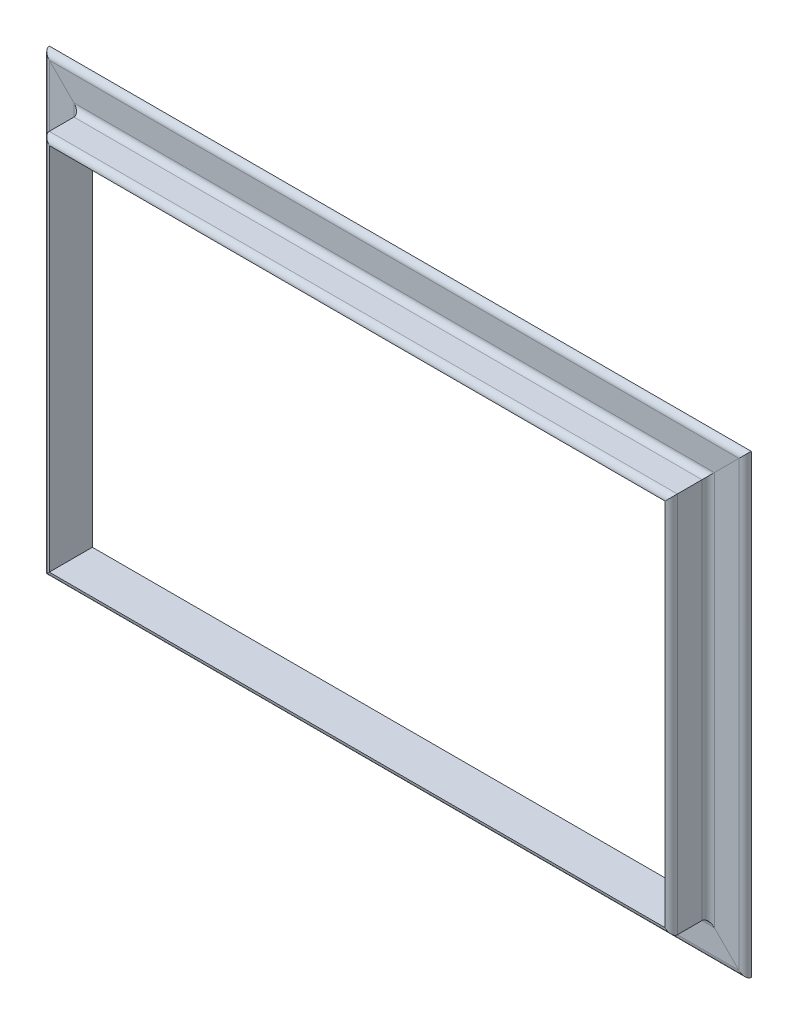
from build123d import *

# Parameters (mm, degrees)
K_TOWNIK_STALOWY_35_X_35_X_5_1_DEPTH      = 550.497474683
K_TOWNIK_STALOWY_35_X_35_X_5_1_DEPTH_BACK = 50.497474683
K_TOWNIK_STALOWY_35_X_35_X_5_1_2_DEPTH    = 400.994949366
K_TOWNIK_STALOWY_35_X_35_X_5_1_3_DEPTH    = 600.994949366
K_TOWNIK_STALOWY_35_X_35_X_5_1_4_DEPTH    = 400.994949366


with BuildPart() as part:
    # Sketch1 → K_townik stalowy 35 X 35 X 5_1 (new, two sides: drawn at the far end of the back side and taken through both)
    with BuildSketch(Plane(origin=(250, -150, 0), x_dir=(0, -1, 0), z_dir=(-1, 0, 0)).offset(-K_TOWNIK_STALOWY_35_X_35_X_5_1_DEPTH_BACK)):
        with BuildLine():
            Line((0, 0), (0, 35))
            ThreePointArc((0, 35), (3.535533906, 33.535533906), (5, 30))
            Line((5, 30), (5, 10))
            ThreePointArc((5, 10), (6.464466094, 6.464466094), (10, 5))
            Line((10, 5), (30, 5))
            ThreePointArc((30, 5), (33.535533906, 3.535533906), (35, 0))
            Line((35, 0), (0, 0))
        make_face()
    extrude(amount=K_TOWNIK_STALOWY_35_X_35_X_5_1_DEPTH + K_TOWNIK_STALOWY_35_X_35_X_5_1_DEPTH_BACK)

    # K_townik stalowy 35 X 35 X 5_1 mitre 1
    split(bisect_by=Plane(origin=(250, -150, 0), x_dir=(0.707106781, -0.707106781, 0), z_dir=(-0.707106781, -0.707106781, 0)), keep=Keep.TOP)

    # K_townik stalowy 35 X 35 X 5_1 mitre 2
    split(bisect_by=Plane(origin=(-250, -150, 0), x_dir=(0.707106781, 0.707106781, 0), z_dir=(0.707106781, -0.707106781, 0)), keep=Keep.TOP)


with BuildPart() as body_2:
    # Sketch1 on segment 2 (on carried to segment 2) → K_townik stalowy 35 X 35 X 5_1 2 (new body)
    with BuildSketch(Plane(origin=(-250, -200.497474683, 0), x_dir=(-1, 0, 0), z_dir=(0, 1, 0))):
        with BuildLine():
            Line((0, 0), (0, 35))
            ThreePointArc((0, 35), (3.535533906, 33.535533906), (5, 30))
            Line((5, 30), (5, 10))
            ThreePointArc((5, 10), (6.464466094, 6.464466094), (10, 5))
            Line((10, 5), (30, 5))
            ThreePointArc((30, 5), (33.535533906, 3.535533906), (35, 0))
            Line((35, 0), (0, 0))
        make_face()
    extrude(amount=K_TOWNIK_STALOWY_35_X_35_X_5_1_2_DEPTH)

    # K_townik stalowy 35 X 35 X 5_1 2 mitre 1
    split(bisect_by=Plane(origin=(-250, -150, 0), x_dir=(-0.707106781, -0.707106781, 0), z_dir=(-0.707106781, 0.707106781, 0)), keep=Keep.TOP)

    # K_townik stalowy 35 X 35 X 5_1 2 mitre 2
    split(bisect_by=Plane(origin=(-250, 150, 0), x_dir=(0.707106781, -0.707106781, 0), z_dir=(-0.707106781, -0.707106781, 0)), keep=Keep.TOP)


with BuildPart() as body_3:
    # Sketch1 on segment 3 (on carried to segment 3) → K_townik stalowy 35 X 35 X 5_1 3 (new body)
    with BuildSketch(Plane(origin=(-300.497474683, 150, 0), x_dir=(0, 1, 0), z_dir=(1, 0, 0))):
        with BuildLine():
            Line((0, 0), (0, 35))
            ThreePointArc((0, 35), (3.535533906, 33.535533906), (5, 30))
            Line((5, 30), (5, 10))
            ThreePointArc((5, 10), (6.464466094, 6.464466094), (10, 5))
            Line((10, 5), (30, 5))
            ThreePointArc((30, 5), (33.535533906, 3.535533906), (35, 0))
            Line((35, 0), (0, 0))
        make_face()
    extrude(amount=K_TOWNIK_STALOWY_35_X_35_X_5_1_3_DEPTH)

    # K_townik stalowy 35 X 35 X 5_1 3 mitre 1
    split(bisect_by=Plane(origin=(250, 150, 0), x_dir=(-0.707106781, -0.707106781, 0), z_dir=(-0.707106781, 0.707106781, 0)), keep=Keep.TOP)

    # K_townik stalowy 35 X 35 X 5_1 3 mitre 2
    split(bisect_by=Plane(origin=(-250, 150, 0), x_dir=(-0.707106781, 0.707106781, 0), z_dir=(0.707106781, 0.707106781, 0)), keep=Keep.TOP)


with BuildPart() as body_4:
    # Sketch1 on segment 4 (on carried to segment 4) → K_townik stalowy 35 X 35 X 5_1 4 (new body)
    with BuildSketch(Plane(origin=(250, 200.497474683, 0), x_dir=(1, 0, 0), z_dir=(0, -1, 0))):
        with BuildLine():
            Line((0, 0), (0, 35))
            ThreePointArc((0, 35), (3.535533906, 33.535533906), (5, 30))
            Line((5, 30), (5, 10))
            ThreePointArc((5, 10), (6.464466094, 6.464466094), (10, 5))
            Line((10, 5), (30, 5))
            ThreePointArc((30, 5), (33.535533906, 3.535533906), (35, 0))
            Line((35, 0), (0, 0))
        make_face()
    extrude(amount=K_TOWNIK_STALOWY_35_X_35_X_5_1_4_DEPTH)

    # K_townik stalowy 35 X 35 X 5_1 4 mitre 1
    split(bisect_by=Plane(origin=(250, -150, 0), x_dir=(-0.707106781, 0.707106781, 0), z_dir=(0.707106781, 0.707106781, 0)), keep=Keep.TOP)

    # K_townik stalowy 35 X 35 X 5_1 4 mitre 2
    split(bisect_by=Plane(origin=(250, 150, 0), x_dir=(0.707106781, 0.707106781, 0), z_dir=(0.707106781, -0.707106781, 0)), keep=Keep.TOP)


solid = Compound([part.part, body_2.part, body_3.part, body_4.part])
